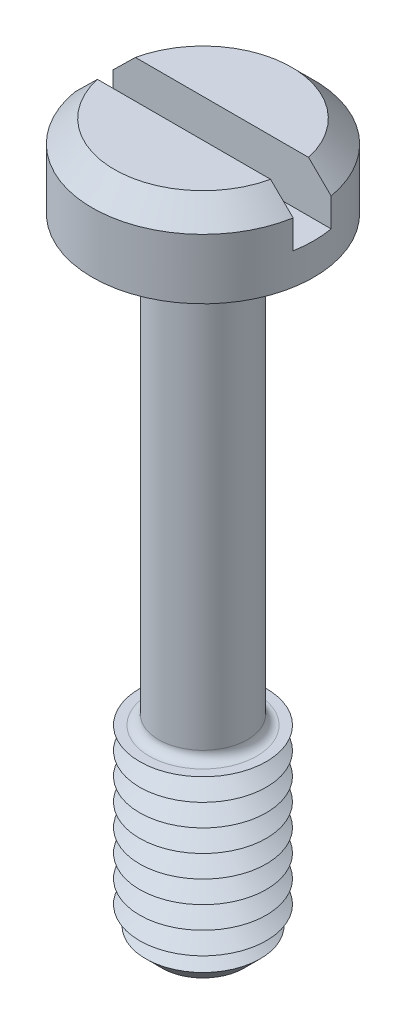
ISO-10303-21;
HEADER;
FILE_DESCRIPTION(('STEP AP214'),'2;1');
FILE_NAME('part.step','',(''),(''),'','','');
FILE_SCHEMA(('AUTOMOTIVE_DESIGN { 1 0 10303 214 1 1 1 1 }'));
ENDSEC;
DATA;
#1=APPLICATION_CONTEXT('core data for automotive mechanical design processes');
#2=APPLICATION_PROTOCOL_DEFINITION('international standard','automotive_design',2000,#1);
#3=PRODUCT_CONTEXT('',#1,'mechanical');
#4=PRODUCT('Part','Part','',(#3));
#5=PRODUCT_RELATED_PRODUCT_CATEGORY('part','',(#4));
#6=PRODUCT_DEFINITION_FORMATION('','',#4);
#7=PRODUCT_DEFINITION_CONTEXT('part definition',#1,'design');
#8=PRODUCT_DEFINITION('design','',#6,#7);
#9=PRODUCT_DEFINITION_SHAPE('','',#8);
#10=(LENGTH_UNIT() NAMED_UNIT(*) SI_UNIT(.MILLI.,.METRE.));
#11=(NAMED_UNIT(*) PLANE_ANGLE_UNIT() SI_UNIT($,.RADIAN.));
#12=(NAMED_UNIT(*) SI_UNIT($,.STERADIAN.) SOLID_ANGLE_UNIT());
#13=UNCERTAINTY_MEASURE_WITH_UNIT(LENGTH_MEASURE(1.E-05),#10,'distance_accuracy_value','');
#14=(GEOMETRIC_REPRESENTATION_CONTEXT(3) GLOBAL_UNCERTAINTY_ASSIGNED_CONTEXT((#13)) GLOBAL_UNIT_ASSIGNED_CONTEXT((#10,
#11,#12)) REPRESENTATION_CONTEXT('',''));
#15=CARTESIAN_POINT('',(0.,0.,0.));
#16=DIRECTION('',(0.,0.,1.));
#17=DIRECTION('',(1.,0.,0.));
#18=AXIS2_PLACEMENT_3D('',#15,#16,#17);
#19=CARTESIAN_POINT('',(0.,2.6,0.));
#20=DIRECTION('',(0.,1.,0.));
#21=DIRECTION('',(0.,0.,1.));
#22=AXIS2_PLACEMENT_3D('',#19,#20,#21);
#23=PLANE('',#22);
#24=DIRECTION('',(-1.,0.,0.));
#25=VECTOR('',#24,1.);
#26=CARTESIAN_POINT('',(3.5,2.6,-0.6));
#27=LINE('',#26,#25);
#28=CARTESIAN_POINT('',(2.73495886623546,2.6,-0.6));
#29=VERTEX_POINT('',#28);
#30=CARTESIAN_POINT('',(-2.73495886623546,2.6,-0.6));
#31=VERTEX_POINT('',#30);
#32=EDGE_CURVE('E110',#29,#31,#27,.T.);
#33=ORIENTED_EDGE('',*,*,#32,.F.);
#34=CARTESIAN_POINT('',(0.,2.6,0.));
#35=DIRECTION('',(0.,1.,0.));
#36=DIRECTION('',(0.,0.,1.));
#37=AXIS2_PLACEMENT_3D('',#34,#35,#36);
#38=CIRCLE('',#37,2.79999999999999);
#39=EDGE_CURVE('E113',#29,#31,#38,.T.);
#40=ORIENTED_EDGE('',*,*,#39,.T.);
#41=EDGE_LOOP('',(#33,#40));
#42=FACE_BOUND('',#41,.T.);
#43=ADVANCED_FACE('F39',(#42),#23,.T.);
#44=CARTESIAN_POINT('',(0.,2.6,0.));
#45=DIRECTION('',(0.,-1.,0.));
#46=DIRECTION('',(0.,0.,-1.));
#47=AXIS2_PLACEMENT_3D('',#44,#45,#46);
#48=CONICAL_SURFACE('',#47,2.79999999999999,0.785398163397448);
#49=CARTESIAN_POINT('',(7.69779986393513,-2.32114776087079,-0.6));
#50=CARTESIAN_POINT('',(7.42456340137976,-2.04874480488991,-0.6));
#51=CARTESIAN_POINT('',(7.15128998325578,-1.77637887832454,-0.6));
#52=CARTESIAN_POINT('',(6.60460779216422,-1.23176088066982,-0.6));
#53=CARTESIAN_POINT('',(6.33119901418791,-0.959508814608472,-0.6));
#54=CARTESIAN_POINT('',(5.78393918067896,-0.41491410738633,-0.6));
#55=CARTESIAN_POINT('',(5.51008795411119,-0.142571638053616,-0.6));
#56=CARTESIAN_POINT('',(4.9621249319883,0.401829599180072,-0.6));
#57=CARTESIAN_POINT('',(4.68801314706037,0.673888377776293,-0.6));
#58=CARTESIAN_POINT('',(4.15230810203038,1.204717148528,-0.6));
#59=CARTESIAN_POINT('',(3.89073524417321,1.4635077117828,-0.6));
#60=CARTESIAN_POINT('',(3.49781694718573,1.85115830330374,-0.6));
#61=CARTESIAN_POINT('',(3.36674319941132,1.98029362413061,-0.6));
#62=CARTESIAN_POINT('',(3.10433907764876,2.23830030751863,-0.6));
#63=CARTESIAN_POINT('',(2.97300870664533,2.36717167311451,-0.6));
#64=CARTESIAN_POINT('',(2.71005235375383,2.62445652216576,-0.6));
#65=CARTESIAN_POINT('',(2.57842659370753,2.75287023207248,-0.6));
#66=CARTESIAN_POINT('',(2.31459302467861,3.00911021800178,-0.6));
#67=CARTESIAN_POINT('',(2.1823851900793,3.13693646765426,-0.6));
#68=CARTESIAN_POINT('',(1.91706128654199,3.39159289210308,-0.6));
#69=CARTESIAN_POINT('',(1.78394541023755,3.51842326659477,-0.6));
#70=CARTESIAN_POINT('',(1.5829745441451,3.70728046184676,-0.6));
#71=CARTESIAN_POINT('',(1.51577053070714,3.76999922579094,-0.6));
#72=CARTESIAN_POINT('',(1.38073587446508,3.89475766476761,-0.6));
#73=CARTESIAN_POINT('',(1.31290524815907,3.95679735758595,-0.6));
#74=CARTESIAN_POINT('',(1.20662362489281,4.05253127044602,-0.6));
#75=CARTESIAN_POINT('',(1.16849592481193,4.08658409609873,-0.6));
#76=CARTESIAN_POINT('',(1.09186306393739,4.15427097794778,-0.6));
#77=CARTESIAN_POINT('',(1.05335786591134,4.18790499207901,-0.6));
#78=CARTESIAN_POINT('',(0.975560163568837,4.25487029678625,-0.6));
#79=CARTESIAN_POINT('',(0.936263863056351,4.28819718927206,-0.6));
#80=CARTESIAN_POINT('',(0.857023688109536,4.3540539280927,-0.6));
#81=CARTESIAN_POINT('',(0.817079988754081,4.38658398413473,-0.6));
#82=CARTESIAN_POINT('',(0.73593206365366,4.45080389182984,-0.6));
#83=CARTESIAN_POINT('',(0.694719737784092,4.48248357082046,-0.6));
#84=CARTESIAN_POINT('',(0.611023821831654,4.54411116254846,-0.6));
#85=CARTESIAN_POINT('',(0.568540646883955,4.5740596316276,-0.6));
#86=CARTESIAN_POINT('',(0.482031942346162,4.63104137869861,-0.6));
#87=CARTESIAN_POINT('',(0.438018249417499,4.65809235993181,-0.6));
#88=CARTESIAN_POINT('',(0.347545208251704,4.70764477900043,-0.6));
#89=CARTESIAN_POINT('',(0.301093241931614,4.73015905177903,-0.6));
#90=CARTESIAN_POINT('',(0.21684063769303,4.76288589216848,-0.6));
#91=CARTESIAN_POINT('',(0.179711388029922,4.77476119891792,-0.6));
#92=CARTESIAN_POINT('',(0.104069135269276,4.79214056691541,-0.6));
#93=CARTESIAN_POINT('',(0.0655630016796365,4.79767265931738,-0.6));
#94=CARTESIAN_POINT('',(-0.0121083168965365,4.80113734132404,-0.6));
#95=CARTESIAN_POINT('',(-0.051276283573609,4.7990121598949,-0.6));
#96=CARTESIAN_POINT('',(-0.128601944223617,4.78758103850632,-0.6));
#97=CARTESIAN_POINT('',(-0.166755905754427,4.77825158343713,-0.6));
#98=CARTESIAN_POINT('',(-0.239985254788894,4.75468984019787,-0.6));
#99=CARTESIAN_POINT('',(-0.275121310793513,4.74063623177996,-0.6));
#100=CARTESIAN_POINT('',(-0.343859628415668,4.70912771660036,-0.6));
#101=CARTESIAN_POINT('',(-0.377459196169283,4.69166709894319,-0.6));
#102=CARTESIAN_POINT('',(-0.443620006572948,4.65431398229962,-0.6));
#103=CARTESIAN_POINT('',(-0.476170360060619,4.63440256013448,-0.6));
#104=CARTESIAN_POINT('',(-0.540208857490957,4.5930114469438,-0.6));
#105=CARTESIAN_POINT('',(-0.571697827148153,4.57153301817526,-0.6));
#106=CARTESIAN_POINT('',(-0.63642661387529,4.52565712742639,-0.6));
#107=CARTESIAN_POINT('',(-0.669598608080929,4.50116466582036,-0.6));
#108=CARTESIAN_POINT('',(-0.735238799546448,4.4512509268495,-0.6));
#109=CARTESIAN_POINT('',(-0.767706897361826,4.4258295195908,-0.6));
#110=CARTESIAN_POINT('',(-0.864340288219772,4.34853769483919,-0.6));
#111=CARTESIAN_POINT('',(-0.927700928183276,4.29566444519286,-0.6));
#112=CARTESIAN_POINT('',(-1.05322030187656,4.18829389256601,-0.6));
#113=CARTESIAN_POINT('',(-1.11537654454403,4.13379371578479,-0.6));
#114=CARTESIAN_POINT('',(-1.23879800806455,4.02383276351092,-0.6));
#115=CARTESIAN_POINT('',(-1.30006349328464,3.96837228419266,-0.6));
#116=CARTESIAN_POINT('',(-1.42182653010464,3.85695373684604,-0.6));
#117=CARTESIAN_POINT('',(-1.48232573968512,3.8009974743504,-0.6));
#118=CARTESIAN_POINT('',(-1.60290045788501,3.68862177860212,-0.6));
#119=CARTESIAN_POINT('',(-1.66297593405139,3.63220231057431,-0.6));
#120=CARTESIAN_POINT('',(-1.84259490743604,3.46258196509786,-0.6));
#121=CARTESIAN_POINT('',(-1.96167258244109,3.34888831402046,-0.6));
#122=CARTESIAN_POINT('',(-2.19942862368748,3.12043467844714,-0.6));
#123=CARTESIAN_POINT('',(-2.31810499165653,3.00567262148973,-0.6));
#124=CARTESIAN_POINT('',(-2.55498513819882,2.77566147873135,-0.6));
#125=CARTESIAN_POINT('',(-2.67318891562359,2.66041239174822,-0.6));
#126=CARTESIAN_POINT('',(-3.0273377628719,2.31418176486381,-0.6));
#127=CARTESIAN_POINT('',(-3.26281496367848,2.08272206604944,-0.6));
#128=CARTESIAN_POINT('',(-3.73326607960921,1.6190281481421,-0.6));
#129=CARTESIAN_POINT('',(-3.96823963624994,1.38679356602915,-0.6));
#130=CARTESIAN_POINT('',(-4.43780370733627,0.921942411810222,-0.6));
#131=CARTESIAN_POINT('',(-4.67239422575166,0.689325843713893,-0.6));
#132=CARTESIAN_POINT('',(-5.13982382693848,0.225350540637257,-0.6));
#133=CARTESIAN_POINT('',(-5.37266445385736,-0.00600663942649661,-0.6));
#134=CARTESIAN_POINT('',(-5.83818541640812,-0.468883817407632,-0.6));
#135=CARTESIAN_POINT('',(-6.07086575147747,-0.700403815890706,-0.6));
#136=CARTESIAN_POINT('',(-6.53596926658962,-1.16341429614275,-0.6));
#137=CARTESIAN_POINT('',(-6.76839251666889,-1.39490470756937,-0.6));
#138=CARTESIAN_POINT('',(-7.23315324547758,-1.85796986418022,-0.6));
#139=CARTESIAN_POINT('',(-7.46549072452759,-2.08954460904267,-0.6));
#140=CARTESIAN_POINT('',(-7.69779986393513,-2.32114776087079,-0.6));
#141=B_SPLINE_CURVE_WITH_KNOTS('',3,(#49,#50,#51,#52,#53,#54,#55,#56,#57,#58,#59,#60,#61,#62,
#63,#64,#65,#66,#67,#68,#69,#70,#71,#72,#73,#74,#75,#76,#77,#78,#79,#80,#81,#82,#83,#84,#85,#86,
#87,#88,#89,#90,#91,#92,#93,#94,#95,#96,#97,#98,#99,#100,#101,#102,#103,#104,#105,#106,#107,
#108,#109,#110,#111,#112,#113,#114,#115,#116,#117,#118,#119,#120,#121,#122,#123,#124,#125,#126,
#127,#128,#129,#130,#131,#132,#133,#134,#135,#136,#137,#138,#139,#140),.UNSPECIFIED.,.F.,.F.,(4,
2,2,2,2,2,2,2,2,2,2,2,2,2,2,2,2,2,2,2,2,2,2,2,2,2,2,2,2,2,2,2,2,2,2,2,2,2,2,2,2,2,2,2,2,4),(0.,
1.15747738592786,2.31500139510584,3.4736574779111,4.63226817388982,5.73614050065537,
6.28814234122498,6.84013779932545,7.39180548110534,7.94349768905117,8.49507629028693,
8.77084567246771,9.04660781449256,9.19996738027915,9.35334222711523,9.50791164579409,
9.66243993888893,9.81835637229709,9.9742224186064,10.1290741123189,10.2834813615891,
10.4000294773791,10.5160605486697,10.6329688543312,10.7502603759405,10.8635386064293,
10.9770083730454,11.0914168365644,11.205734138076,11.3294140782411,11.4531113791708,
11.7006314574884,11.9486181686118,12.1965297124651,12.4437540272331,12.6909970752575,
13.184904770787,13.6801705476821,14.1754375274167,15.1659939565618,16.1571087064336,
17.1482131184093,18.1329303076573,19.1176509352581,20.1017623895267,21.0858701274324),.UNSPECIFIED.);
#142=CARTESIAN_POINT('',(3.44818792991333,1.89999999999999,-0.6));
#143=VERTEX_POINT('',#142);
#144=EDGE_CURVE('E259',#143,#29,#141,.T.);
#145=ORIENTED_EDGE('',*,*,#144,.F.);
#146=CARTESIAN_POINT('',(0.,1.89999999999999,0.));
#147=DIRECTION('',(0.,1.,0.));
#148=DIRECTION('',(0.,0.,1.));
#149=AXIS2_PLACEMENT_3D('',#146,#147,#148);
#150=CIRCLE('',#149,3.5);
#151=CARTESIAN_POINT('',(-3.44818792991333,1.89999999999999,-0.6));
#152=VERTEX_POINT('',#151);
#153=EDGE_CURVE('E127',#152,#143,#150,.F.);
#154=ORIENTED_EDGE('',*,*,#153,.F.);
#155=EDGE_CURVE('E102',#31,#152,#141,.T.);
#156=ORIENTED_EDGE('',*,*,#155,.F.);
#157=ORIENTED_EDGE('',*,*,#39,.F.);
#158=EDGE_LOOP('',(#145,#154,#156,#157));
#159=FACE_BOUND('',#158,.T.);
#160=ADVANCED_FACE('F221',(#159),#48,.T.);
#161=CARTESIAN_POINT('',(0.,-20.,0.));
#162=DIRECTION('',(0.,1.,0.));
#163=DIRECTION('',(0.,0.,1.));
#164=AXIS2_PLACEMENT_3D('',#161,#162,#163);
#165=CYLINDRICAL_SURFACE('',#164,1.4);
#166=CARTESIAN_POINT('',(0.,-13.7,0.));
#167=DIRECTION('',(0.,-1.,0.));
#168=DIRECTION('',(0.,0.,-1.));
#169=AXIS2_PLACEMENT_3D('',#166,#167,#168);
#170=CIRCLE('',#169,1.4);
#171=CARTESIAN_POINT('',(0.,-13.7,-1.4));
#172=VERTEX_POINT('',#171);
#173=EDGE_CURVE('E123',#172,#172,#170,.F.);
#174=ORIENTED_EDGE('',*,*,#173,.T.);
#175=EDGE_LOOP('',(#174));
#176=FACE_BOUND('',#175,.T.);
#177=CARTESIAN_POINT('',(0.,-0.300000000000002,0.));
#178=DIRECTION('',(0.,1.,0.));
#179=DIRECTION('',(0.,0.,1.));
#180=AXIS2_PLACEMENT_3D('',#177,#178,#179);
#181=CIRCLE('',#180,1.4);
#182=CARTESIAN_POINT('',(0.,-0.300000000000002,1.4));
#183=VERTEX_POINT('',#182);
#184=EDGE_CURVE('E365',#183,#183,#181,.F.);
#185=ORIENTED_EDGE('',*,*,#184,.T.);
#186=EDGE_LOOP('',(#185));
#187=FACE_BOUND('',#186,.T.);
#188=ADVANCED_FACE('F217',(#176,#187),#165,.T.);
#189=CARTESIAN_POINT('',(0.,2.6,0.));
#190=DIRECTION('',(0.,-1.,0.));
#191=DIRECTION('',(0.,0.,-1.));
#192=AXIS2_PLACEMENT_3D('',#189,#190,#191);
#193=CYLINDRICAL_SURFACE('',#192,3.5);
#194=ORIENTED_EDGE('',*,*,#153,.T.);
#195=DIRECTION('',(0.,-1.,0.));
#196=VECTOR('',#195,1.);
#197=CARTESIAN_POINT('',(3.44818792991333,2.6,-0.6));
#198=LINE('',#197,#196);
#199=CARTESIAN_POINT('',(3.44818792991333,1.,-0.6));
#200=VERTEX_POINT('',#199);
#201=EDGE_CURVE('E64',#143,#200,#198,.T.);
#202=ORIENTED_EDGE('',*,*,#201,.T.);
#203=CARTESIAN_POINT('',(0.,1.,0.));
#204=DIRECTION('',(0.,1.,0.));
#205=DIRECTION('',(0.,0.,1.));
#206=AXIS2_PLACEMENT_3D('',#203,#204,#205);
#207=CIRCLE('',#206,3.5);
#208=CARTESIAN_POINT('',(3.44818792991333,1.,0.6));
#209=VERTEX_POINT('',#208);
#210=EDGE_CURVE('E11',#209,#200,#207,.T.);
#211=ORIENTED_EDGE('',*,*,#210,.F.);
#212=DIRECTION('',(0.,-1.,0.));
#213=VECTOR('',#212,1.);
#214=CARTESIAN_POINT('',(3.44818792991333,2.6,0.6));
#215=LINE('',#214,#213);
#216=CARTESIAN_POINT('',(3.44818792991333,1.89999999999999,0.6));
#217=VERTEX_POINT('',#216);
#218=EDGE_CURVE('E278',#209,#217,#215,.F.);
#219=ORIENTED_EDGE('',*,*,#218,.T.);
#220=CARTESIAN_POINT('',(-3.44818792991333,1.89999999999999,0.6));
#221=VERTEX_POINT('',#220);
#222=EDGE_CURVE('E120',#217,#221,#150,.F.);
#223=ORIENTED_EDGE('',*,*,#222,.T.);
#224=DIRECTION('',(0.,-1.,0.));
#225=VECTOR('',#224,1.);
#226=CARTESIAN_POINT('',(-3.44818792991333,2.6,0.6));
#227=LINE('',#226,#225);
#228=CARTESIAN_POINT('',(-3.44818792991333,1.,0.6));
#229=VERTEX_POINT('',#228);
#230=EDGE_CURVE('E96',#221,#229,#227,.T.);
#231=ORIENTED_EDGE('',*,*,#230,.T.);
#232=CARTESIAN_POINT('',(-3.44818792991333,1.,-0.6));
#233=VERTEX_POINT('',#232);
#234=EDGE_CURVE('E44',#233,#229,#207,.T.);
#235=ORIENTED_EDGE('',*,*,#234,.F.);
#236=DIRECTION('',(0.,-1.,0.));
#237=VECTOR('',#236,1.);
#238=CARTESIAN_POINT('',(-3.44818792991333,2.6,-0.6));
#239=LINE('',#238,#237);
#240=EDGE_CURVE('E282',#233,#152,#239,.F.);
#241=ORIENTED_EDGE('',*,*,#240,.T.);
#242=EDGE_LOOP('',(#194,#202,#211,#219,#223,#231,#235,#241));
#243=FACE_BOUND('',#242,.T.);
#244=CARTESIAN_POINT('',(0.,0.,0.));
#245=DIRECTION('',(0.,1.,0.));
#246=DIRECTION('',(0.,0.,1.));
#247=AXIS2_PLACEMENT_3D('',#244,#245,#246);
#248=CIRCLE('',#247,3.5);
#249=CARTESIAN_POINT('',(0.,0.,3.5));
#250=VERTEX_POINT('',#249);
#251=EDGE_CURVE('E350',#250,#250,#248,.T.);
#252=ORIENTED_EDGE('',*,*,#251,.T.);
#253=EDGE_LOOP('',(#252));
#254=FACE_BOUND('',#253,.T.);
#255=ADVANCED_FACE('F220',(#243,#254),#193,.T.);
#256=DIRECTION('',(1.,0.,0.));
#257=VECTOR('',#256,1.);
#258=CARTESIAN_POINT('',(3.5,2.6,0.6));
#259=LINE('',#258,#257);
#260=CARTESIAN_POINT('',(-2.73495886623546,2.6,0.6));
#261=VERTEX_POINT('',#260);
#262=CARTESIAN_POINT('',(2.73495886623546,2.6,0.6));
#263=VERTEX_POINT('',#262);
#264=EDGE_CURVE('E56',#261,#263,#259,.T.);
#265=ORIENTED_EDGE('',*,*,#264,.F.);
#266=EDGE_CURVE('E108',#261,#263,#38,.T.);
#267=ORIENTED_EDGE('',*,*,#266,.T.);
#268=EDGE_LOOP('',(#265,#267));
#269=FACE_BOUND('',#268,.T.);
#270=ADVANCED_FACE('F107',(#269),#23,.T.);
#271=CARTESIAN_POINT('',(0.,0.,0.));
#272=DIRECTION('',(0.,1.,0.));
#273=DIRECTION('',(0.,0.,1.));
#274=AXIS2_PLACEMENT_3D('',#271,#272,#273);
#275=PLANE('',#274);
#276=CARTESIAN_POINT('',(0.,0.,0.));
#277=DIRECTION('',(0.,1.,0.));
#278=DIRECTION('',(0.,0.,1.));
#279=AXIS2_PLACEMENT_3D('',#276,#277,#278);
#280=CIRCLE('',#279,1.7);
#281=CARTESIAN_POINT('',(0.,0.,1.7));
#282=VERTEX_POINT('',#281);
#283=EDGE_CURVE('E114',#282,#282,#280,.T.);
#284=ORIENTED_EDGE('',*,*,#283,.T.);
#285=EDGE_LOOP('',(#284));
#286=FACE_BOUND('',#285,.T.);
#287=ORIENTED_EDGE('',*,*,#251,.F.);
#288=EDGE_LOOP('',(#287));
#289=FACE_BOUND('',#288,.T.);
#290=ADVANCED_FACE('F211',(#286,#289),#275,.F.);
#291=CARTESIAN_POINT('',(0.,-14.,0.));
#292=DIRECTION('',(0.,-1.,0.));
#293=DIRECTION('',(0.,0.,-1.));
#294=AXIS2_PLACEMENT_3D('',#291,#292,#293);
#295=PLANE('',#294);
#296=CARTESIAN_POINT('',(0.,-14.,0.));
#297=DIRECTION('',(0.,-1.,0.));
#298=DIRECTION('',(0.,0.,-1.));
#299=AXIS2_PLACEMENT_3D('',#296,#297,#298);
#300=CIRCLE('',#299,1.7);
#301=CARTESIAN_POINT('',(0.,-14.,-1.7));
#302=VERTEX_POINT('',#301);
#303=EDGE_CURVE('E358',#302,#302,#300,.T.);
#304=ORIENTED_EDGE('',*,*,#303,.T.);
#305=EDGE_LOOP('',(#304));
#306=FACE_BOUND('',#305,.T.);
#307=CARTESIAN_POINT('',(0.,-14.,0.));
#308=DIRECTION('',(0.,1.,0.));
#309=DIRECTION('',(0.,0.,1.));
#310=AXIS2_PLACEMENT_3D('',#307,#308,#309);
#311=CIRCLE('',#310,2.);
#312=CARTESIAN_POINT('',(0.,-14.,2.));
#313=VERTEX_POINT('',#312);
#314=EDGE_CURVE('E346',#313,#313,#311,.T.);
#315=ORIENTED_EDGE('',*,*,#314,.T.);
#316=EDGE_LOOP('',(#315));
#317=FACE_BOUND('',#316,.T.);
#318=ADVANCED_FACE('F207',(#306,#317),#295,.F.);
#319=CARTESIAN_POINT('',(0.,-14.35,0.));
#320=DIRECTION('',(0.,1.,0.));
#321=DIRECTION('',(0.,0.,1.));
#322=AXIS2_PLACEMENT_3D('',#319,#320,#321);
#323=CONICAL_SURFACE('',#322,1.39378221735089,1.0471975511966);
#324=ORIENTED_EDGE('',*,*,#314,.F.);
#325=EDGE_LOOP('',(#324));
#326=FACE_BOUND('',#325,.T.);
#327=CARTESIAN_POINT('',(0.,-14.35,0.));
#328=DIRECTION('',(0.,1.,0.));
#329=DIRECTION('',(0.,0.,1.));
#330=AXIS2_PLACEMENT_3D('',#327,#328,#329);
#331=CIRCLE('',#330,1.39378221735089);
#332=CARTESIAN_POINT('',(0.,-14.35,1.39378221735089));
#333=VERTEX_POINT('',#332);
#334=EDGE_CURVE('E342',#333,#333,#331,.T.);
#335=ORIENTED_EDGE('',*,*,#334,.T.);
#336=EDGE_LOOP('',(#335));
#337=FACE_BOUND('',#336,.T.);
#338=ADVANCED_FACE('F203',(#326,#337),#323,.T.);
#339=CARTESIAN_POINT('',(0.,-14.7,0.));
#340=DIRECTION('',(0.,-1.,0.));
#341=DIRECTION('',(0.,0.,-1.));
#342=AXIS2_PLACEMENT_3D('',#339,#340,#341);
#343=CONICAL_SURFACE('',#342,2.,1.0471975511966);
#344=ORIENTED_EDGE('',*,*,#334,.F.);
#345=EDGE_LOOP('',(#344));
#346=FACE_BOUND('',#345,.T.);
#347=CARTESIAN_POINT('',(0.,-14.7,0.));
#348=DIRECTION('',(0.,1.,0.));
#349=DIRECTION('',(0.,0.,1.));
#350=AXIS2_PLACEMENT_3D('',#347,#348,#349);
#351=CIRCLE('',#350,2.);
#352=CARTESIAN_POINT('',(0.,-14.7,2.));
#353=VERTEX_POINT('',#352);
#354=EDGE_CURVE('E339',#353,#353,#351,.T.);
#355=ORIENTED_EDGE('',*,*,#354,.T.);
#356=EDGE_LOOP('',(#355));
#357=FACE_BOUND('',#356,.T.);
#358=ADVANCED_FACE('F199',(#346,#357),#343,.T.);
#359=CARTESIAN_POINT('',(0.,-15.05,0.));
#360=DIRECTION('',(0.,1.,0.));
#361=DIRECTION('',(0.,0.,1.));
#362=AXIS2_PLACEMENT_3D('',#359,#360,#361);
#363=CONICAL_SURFACE('',#362,1.39378221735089,1.0471975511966);
#364=ORIENTED_EDGE('',*,*,#354,.F.);
#365=EDGE_LOOP('',(#364));
#366=FACE_BOUND('',#365,.T.);
#367=CARTESIAN_POINT('',(0.,-15.05,0.));
#368=DIRECTION('',(0.,1.,0.));
#369=DIRECTION('',(0.,0.,1.));
#370=AXIS2_PLACEMENT_3D('',#367,#368,#369);
#371=CIRCLE('',#370,1.39378221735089);
#372=CARTESIAN_POINT('',(0.,-15.05,1.39378221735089));
#373=VERTEX_POINT('',#372);
#374=EDGE_CURVE('E335',#373,#373,#371,.T.);
#375=ORIENTED_EDGE('',*,*,#374,.T.);
#376=EDGE_LOOP('',(#375));
#377=FACE_BOUND('',#376,.T.);
#378=ADVANCED_FACE('F195',(#366,#377),#363,.T.);
#379=CARTESIAN_POINT('',(0.,-15.4,0.));
#380=DIRECTION('',(0.,-1.,0.));
#381=DIRECTION('',(0.,0.,-1.));
#382=AXIS2_PLACEMENT_3D('',#379,#380,#381);
#383=CONICAL_SURFACE('',#382,2.,1.0471975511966);
#384=ORIENTED_EDGE('',*,*,#374,.F.);
#385=EDGE_LOOP('',(#384));
#386=FACE_BOUND('',#385,.T.);
#387=CARTESIAN_POINT('',(0.,-15.4,0.));
#388=DIRECTION('',(0.,1.,0.));
#389=DIRECTION('',(0.,0.,1.));
#390=AXIS2_PLACEMENT_3D('',#387,#388,#389);
#391=CIRCLE('',#390,2.);
#392=CARTESIAN_POINT('',(0.,-15.4,2.));
#393=VERTEX_POINT('',#392);
#394=EDGE_CURVE('E331',#393,#393,#391,.T.);
#395=ORIENTED_EDGE('',*,*,#394,.T.);
#396=EDGE_LOOP('',(#395));
#397=FACE_BOUND('',#396,.T.);
#398=ADVANCED_FACE('F191',(#386,#397),#383,.T.);
#399=CARTESIAN_POINT('',(0.,-15.75,0.));
#400=DIRECTION('',(0.,1.,0.));
#401=DIRECTION('',(0.,0.,1.));
#402=AXIS2_PLACEMENT_3D('',#399,#400,#401);
#403=CONICAL_SURFACE('',#402,1.39378221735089,1.0471975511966);
#404=ORIENTED_EDGE('',*,*,#394,.F.);
#405=EDGE_LOOP('',(#404));
#406=FACE_BOUND('',#405,.T.);
#407=CARTESIAN_POINT('',(0.,-15.75,0.));
#408=DIRECTION('',(0.,1.,0.));
#409=DIRECTION('',(0.,0.,1.));
#410=AXIS2_PLACEMENT_3D('',#407,#408,#409);
#411=CIRCLE('',#410,1.39378221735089);
#412=CARTESIAN_POINT('',(0.,-15.75,1.39378221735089));
#413=VERTEX_POINT('',#412);
#414=EDGE_CURVE('E327',#413,#413,#411,.T.);
#415=ORIENTED_EDGE('',*,*,#414,.T.);
#416=EDGE_LOOP('',(#415));
#417=FACE_BOUND('',#416,.T.);
#418=ADVANCED_FACE('F187',(#406,#417),#403,.T.);
#419=CARTESIAN_POINT('',(0.,-16.1,0.));
#420=DIRECTION('',(0.,-1.,0.));
#421=DIRECTION('',(0.,0.,-1.));
#422=AXIS2_PLACEMENT_3D('',#419,#420,#421);
#423=CONICAL_SURFACE('',#422,2.,1.0471975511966);
#424=ORIENTED_EDGE('',*,*,#414,.F.);
#425=EDGE_LOOP('',(#424));
#426=FACE_BOUND('',#425,.T.);
#427=CARTESIAN_POINT('',(0.,-16.1,0.));
#428=DIRECTION('',(0.,1.,0.));
#429=DIRECTION('',(0.,0.,1.));
#430=AXIS2_PLACEMENT_3D('',#427,#428,#429);
#431=CIRCLE('',#430,2.);
#432=CARTESIAN_POINT('',(0.,-16.1,2.));
#433=VERTEX_POINT('',#432);
#434=EDGE_CURVE('E323',#433,#433,#431,.T.);
#435=ORIENTED_EDGE('',*,*,#434,.T.);
#436=EDGE_LOOP('',(#435));
#437=FACE_BOUND('',#436,.T.);
#438=ADVANCED_FACE('F183',(#426,#437),#423,.T.);
#439=CARTESIAN_POINT('',(0.,-16.45,0.));
#440=DIRECTION('',(0.,1.,0.));
#441=DIRECTION('',(0.,0.,1.));
#442=AXIS2_PLACEMENT_3D('',#439,#440,#441);
#443=CONICAL_SURFACE('',#442,1.39378221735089,1.0471975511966);
#444=ORIENTED_EDGE('',*,*,#434,.F.);
#445=EDGE_LOOP('',(#444));
#446=FACE_BOUND('',#445,.T.);
#447=CARTESIAN_POINT('',(0.,-16.45,0.));
#448=DIRECTION('',(0.,1.,0.));
#449=DIRECTION('',(0.,0.,1.));
#450=AXIS2_PLACEMENT_3D('',#447,#448,#449);
#451=CIRCLE('',#450,1.39378221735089);
#452=CARTESIAN_POINT('',(0.,-16.45,1.39378221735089));
#453=VERTEX_POINT('',#452);
#454=EDGE_CURVE('E320',#453,#453,#451,.T.);
#455=ORIENTED_EDGE('',*,*,#454,.T.);
#456=EDGE_LOOP('',(#455));
#457=FACE_BOUND('',#456,.T.);
#458=ADVANCED_FACE('F179',(#446,#457),#443,.T.);
#459=CARTESIAN_POINT('',(0.,-16.8,0.));
#460=DIRECTION('',(0.,-1.,0.));
#461=DIRECTION('',(0.,0.,-1.));
#462=AXIS2_PLACEMENT_3D('',#459,#460,#461);
#463=CONICAL_SURFACE('',#462,2.,1.0471975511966);
#464=ORIENTED_EDGE('',*,*,#454,.F.);
#465=EDGE_LOOP('',(#464));
#466=FACE_BOUND('',#465,.T.);
#467=CARTESIAN_POINT('',(0.,-16.8,0.));
#468=DIRECTION('',(0.,1.,0.));
#469=DIRECTION('',(0.,0.,1.));
#470=AXIS2_PLACEMENT_3D('',#467,#468,#469);
#471=CIRCLE('',#470,2.);
#472=CARTESIAN_POINT('',(0.,-16.8,2.));
#473=VERTEX_POINT('',#472);
#474=EDGE_CURVE('E316',#473,#473,#471,.T.);
#475=ORIENTED_EDGE('',*,*,#474,.T.);
#476=EDGE_LOOP('',(#475));
#477=FACE_BOUND('',#476,.T.);
#478=ADVANCED_FACE('F175',(#466,#477),#463,.T.);
#479=CARTESIAN_POINT('',(0.,-17.15,0.));
#480=DIRECTION('',(0.,1.,0.));
#481=DIRECTION('',(0.,0.,1.));
#482=AXIS2_PLACEMENT_3D('',#479,#480,#481);
#483=CONICAL_SURFACE('',#482,1.39378221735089,1.0471975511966);
#484=ORIENTED_EDGE('',*,*,#474,.F.);
#485=EDGE_LOOP('',(#484));
#486=FACE_BOUND('',#485,.T.);
#487=CARTESIAN_POINT('',(0.,-17.15,0.));
#488=DIRECTION('',(0.,1.,0.));
#489=DIRECTION('',(0.,0.,1.));
#490=AXIS2_PLACEMENT_3D('',#487,#488,#489);
#491=CIRCLE('',#490,1.39378221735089);
#492=CARTESIAN_POINT('',(0.,-17.15,1.39378221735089));
#493=VERTEX_POINT('',#492);
#494=EDGE_CURVE('E312',#493,#493,#491,.T.);
#495=ORIENTED_EDGE('',*,*,#494,.T.);
#496=EDGE_LOOP('',(#495));
#497=FACE_BOUND('',#496,.T.);
#498=ADVANCED_FACE('F171',(#486,#497),#483,.T.);
#499=CARTESIAN_POINT('',(0.,-17.5,0.));
#500=DIRECTION('',(0.,-1.,0.));
#501=DIRECTION('',(0.,0.,-1.));
#502=AXIS2_PLACEMENT_3D('',#499,#500,#501);
#503=CONICAL_SURFACE('',#502,2.,1.0471975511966);
#504=ORIENTED_EDGE('',*,*,#494,.F.);
#505=EDGE_LOOP('',(#504));
#506=FACE_BOUND('',#505,.T.);
#507=CARTESIAN_POINT('',(0.,-17.5,0.));
#508=DIRECTION('',(0.,1.,0.));
#509=DIRECTION('',(0.,0.,1.));
#510=AXIS2_PLACEMENT_3D('',#507,#508,#509);
#511=CIRCLE('',#510,2.);
#512=CARTESIAN_POINT('',(0.,-17.5,2.));
#513=VERTEX_POINT('',#512);
#514=EDGE_CURVE('E308',#513,#513,#511,.T.);
#515=ORIENTED_EDGE('',*,*,#514,.T.);
#516=EDGE_LOOP('',(#515));
#517=FACE_BOUND('',#516,.T.);
#518=ADVANCED_FACE('F167',(#506,#517),#503,.T.);
#519=CARTESIAN_POINT('',(0.,-17.85,0.));
#520=DIRECTION('',(0.,1.,0.));
#521=DIRECTION('',(0.,0.,1.));
#522=AXIS2_PLACEMENT_3D('',#519,#520,#521);
#523=CONICAL_SURFACE('',#522,1.39378221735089,1.0471975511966);
#524=ORIENTED_EDGE('',*,*,#514,.F.);
#525=EDGE_LOOP('',(#524));
#526=FACE_BOUND('',#525,.T.);
#527=CARTESIAN_POINT('',(0.,-17.85,0.));
#528=DIRECTION('',(0.,1.,0.));
#529=DIRECTION('',(0.,0.,1.));
#530=AXIS2_PLACEMENT_3D('',#527,#528,#529);
#531=CIRCLE('',#530,1.39378221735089);
#532=CARTESIAN_POINT('',(0.,-17.85,1.39378221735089));
#533=VERTEX_POINT('',#532);
#534=EDGE_CURVE('E304',#533,#533,#531,.T.);
#535=ORIENTED_EDGE('',*,*,#534,.T.);
#536=EDGE_LOOP('',(#535));
#537=FACE_BOUND('',#536,.T.);
#538=ADVANCED_FACE('F163',(#526,#537),#523,.T.);
#539=CARTESIAN_POINT('',(0.,-18.2,0.));
#540=DIRECTION('',(0.,-1.,0.));
#541=DIRECTION('',(0.,0.,-1.));
#542=AXIS2_PLACEMENT_3D('',#539,#540,#541);
#543=CONICAL_SURFACE('',#542,2.,1.0471975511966);
#544=ORIENTED_EDGE('',*,*,#534,.F.);
#545=EDGE_LOOP('',(#544));
#546=FACE_BOUND('',#545,.T.);
#547=CARTESIAN_POINT('',(0.,-18.2,0.));
#548=DIRECTION('',(0.,1.,0.));
#549=DIRECTION('',(0.,0.,1.));
#550=AXIS2_PLACEMENT_3D('',#547,#548,#549);
#551=CIRCLE('',#550,2.);
#552=CARTESIAN_POINT('',(0.,-18.2,2.));
#553=VERTEX_POINT('',#552);
#554=EDGE_CURVE('E300',#553,#553,#551,.T.);
#555=ORIENTED_EDGE('',*,*,#554,.T.);
#556=EDGE_LOOP('',(#555));
#557=FACE_BOUND('',#556,.T.);
#558=ADVANCED_FACE('F159',(#546,#557),#543,.T.);
#559=CARTESIAN_POINT('',(0.,-18.55,0.));
#560=DIRECTION('',(0.,1.,0.));
#561=DIRECTION('',(0.,0.,1.));
#562=AXIS2_PLACEMENT_3D('',#559,#560,#561);
#563=CONICAL_SURFACE('',#562,1.39378221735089,1.0471975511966);
#564=ORIENTED_EDGE('',*,*,#554,.F.);
#565=EDGE_LOOP('',(#564));
#566=FACE_BOUND('',#565,.T.);
#567=CARTESIAN_POINT('',(0.,-18.55,0.));
#568=DIRECTION('',(0.,1.,0.));
#569=DIRECTION('',(0.,0.,1.));
#570=AXIS2_PLACEMENT_3D('',#567,#568,#569);
#571=CIRCLE('',#570,1.39378221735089);
#572=CARTESIAN_POINT('',(0.,-18.55,1.39378221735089));
#573=VERTEX_POINT('',#572);
#574=EDGE_CURVE('E297',#573,#573,#571,.T.);
#575=ORIENTED_EDGE('',*,*,#574,.T.);
#576=EDGE_LOOP('',(#575));
#577=FACE_BOUND('',#576,.T.);
#578=ADVANCED_FACE('F155',(#566,#577),#563,.T.);
#579=CARTESIAN_POINT('',(0.,-18.9,0.));
#580=DIRECTION('',(0.,-1.,0.));
#581=DIRECTION('',(0.,0.,-1.));
#582=AXIS2_PLACEMENT_3D('',#579,#580,#581);
#583=CONICAL_SURFACE('',#582,2.,1.0471975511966);
#584=ORIENTED_EDGE('',*,*,#574,.F.);
#585=EDGE_LOOP('',(#584));
#586=FACE_BOUND('',#585,.T.);
#587=CARTESIAN_POINT('',(0.,-18.9,0.));
#588=DIRECTION('',(0.,1.,0.));
#589=DIRECTION('',(0.,0.,1.));
#590=AXIS2_PLACEMENT_3D('',#587,#588,#589);
#591=CIRCLE('',#590,2.);
#592=CARTESIAN_POINT('',(0.,-18.9,2.));
#593=VERTEX_POINT('',#592);
#594=EDGE_CURVE('E292',#593,#593,#591,.T.);
#595=ORIENTED_EDGE('',*,*,#594,.T.);
#596=EDGE_LOOP('',(#595));
#597=FACE_BOUND('',#596,.T.);
#598=ADVANCED_FACE('F151',(#586,#597),#583,.T.);
#599=CARTESIAN_POINT('',(0.,-19.25,0.));
#600=DIRECTION('',(0.,1.,0.));
#601=DIRECTION('',(0.,0.,1.));
#602=AXIS2_PLACEMENT_3D('',#599,#600,#601);
#603=CONICAL_SURFACE('',#602,1.39378221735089,1.0471975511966);
#604=ORIENTED_EDGE('',*,*,#594,.F.);
#605=EDGE_LOOP('',(#604));
#606=FACE_BOUND('',#605,.T.);
#607=CARTESIAN_POINT('',(0.,-19.25,0.));
#608=DIRECTION('',(0.,1.,0.));
#609=DIRECTION('',(0.,0.,1.));
#610=AXIS2_PLACEMENT_3D('',#607,#608,#609);
#611=CIRCLE('',#610,1.39378221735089);
#612=CARTESIAN_POINT('',(0.,-19.25,1.39378221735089));
#613=VERTEX_POINT('',#612);
#614=EDGE_CURVE('E288',#613,#613,#611,.T.);
#615=ORIENTED_EDGE('',*,*,#614,.T.);
#616=EDGE_LOOP('',(#615));
#617=FACE_BOUND('',#616,.T.);
#618=ADVANCED_FACE('F147',(#606,#617),#603,.T.);
#619=CARTESIAN_POINT('',(0.,-19.6,0.));
#620=DIRECTION('',(0.,-1.,0.));
#621=DIRECTION('',(0.,0.,-1.));
#622=AXIS2_PLACEMENT_3D('',#619,#620,#621);
#623=CONICAL_SURFACE('',#622,2.,1.0471975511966);
#624=CARTESIAN_POINT('',(0.,-19.4901923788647,0.));
#625=DIRECTION('',(0.,-1.,0.));
#626=DIRECTION('',(0.,0.,-1.));
#627=AXIS2_PLACEMENT_3D('',#624,#625,#626);
#628=CIRCLE('',#627,1.80980762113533);
#629=CARTESIAN_POINT('',(0.,-19.4901923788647,-1.80980762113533));
#630=VERTEX_POINT('',#629);
#631=EDGE_CURVE('E296',#630,#630,#628,.F.);
#632=ORIENTED_EDGE('',*,*,#631,.T.);
#633=EDGE_LOOP('',(#632));
#634=FACE_BOUND('',#633,.T.);
#635=ORIENTED_EDGE('',*,*,#614,.F.);
#636=EDGE_LOOP('',(#635));
#637=FACE_BOUND('',#636,.T.);
#638=ADVANCED_FACE('F143',(#634,#637),#623,.T.);
#639=CARTESIAN_POINT('',(0.,-20.,0.));
#640=DIRECTION('',(0.,-1.,0.));
#641=DIRECTION('',(0.,0.,-1.));
#642=AXIS2_PLACEMENT_3D('',#639,#640,#641);
#643=PLANE('',#642);
#644=CARTESIAN_POINT('',(0.,-20.,0.));
#645=DIRECTION('',(0.,-1.,0.));
#646=DIRECTION('',(0.,0.,-1.));
#647=AXIS2_PLACEMENT_3D('',#644,#645,#646);
#648=CIRCLE('',#647,1.3);
#649=CARTESIAN_POINT('',(0.,-20.,-1.3));
#650=VERTEX_POINT('',#649);
#651=EDGE_CURVE('E354',#650,#650,#648,.T.);
#652=ORIENTED_EDGE('',*,*,#651,.T.);
#653=EDGE_LOOP('',(#652));
#654=FACE_BOUND('',#653,.T.);
#655=ADVANCED_FACE('F146',(#654),#643,.T.);
#656=CARTESIAN_POINT('',(0.,-20.,0.));
#657=DIRECTION('',(0.,1.,0.));
#658=DIRECTION('',(0.,0.,1.));
#659=AXIS2_PLACEMENT_3D('',#656,#657,#658);
#660=CONICAL_SURFACE('',#659,1.3,0.785398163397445);
#661=ORIENTED_EDGE('',*,*,#631,.F.);
#662=EDGE_LOOP('',(#661));
#663=FACE_BOUND('',#662,.T.);
#664=ORIENTED_EDGE('',*,*,#651,.F.);
#665=EDGE_LOOP('',(#664));
#666=FACE_BOUND('',#665,.T.);
#667=ADVANCED_FACE('F215',(#663,#666),#660,.T.);
#668=CARTESIAN_POINT('',(0.,-13.7,0.));
#669=DIRECTION('',(0.,-1.,0.));
#670=DIRECTION('',(0.,0.,-1.));
#671=AXIS2_PLACEMENT_3D('',#668,#669,#670);
#672=TOROIDAL_SURFACE('',#671,1.7,0.3);
#673=ORIENTED_EDGE('',*,*,#173,.F.);
#674=EDGE_LOOP('',(#673));
#675=FACE_BOUND('',#674,.T.);
#676=ORIENTED_EDGE('',*,*,#303,.F.);
#677=EDGE_LOOP('',(#676));
#678=FACE_BOUND('',#677,.T.);
#679=ADVANCED_FACE('F233',(#675,#678),#672,.F.);
#680=CARTESIAN_POINT('',(0.,-0.300000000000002,0.));
#681=DIRECTION('',(0.,1.,0.));
#682=DIRECTION('',(0.,0.,1.));
#683=AXIS2_PLACEMENT_3D('',#680,#681,#682);
#684=TOROIDAL_SURFACE('',#683,1.7,0.3);
#685=ORIENTED_EDGE('',*,*,#283,.F.);
#686=EDGE_LOOP('',(#685));
#687=FACE_BOUND('',#686,.T.);
#688=ORIENTED_EDGE('',*,*,#184,.F.);
#689=EDGE_LOOP('',(#688));
#690=FACE_BOUND('',#689,.T.);
#691=ADVANCED_FACE('F236',(#687,#690),#684,.F.);
#692=CARTESIAN_POINT('',(-7.69779986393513,-2.32114776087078,0.6));
#693=CARTESIAN_POINT('',(-7.42456340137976,-2.0487448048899,0.6));
#694=CARTESIAN_POINT('',(-7.15128998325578,-1.77637887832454,0.6));
#695=CARTESIAN_POINT('',(-6.60460779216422,-1.23176088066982,0.6));
#696=CARTESIAN_POINT('',(-6.33119901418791,-0.959508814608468,0.6));
#697=CARTESIAN_POINT('',(-5.78393918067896,-0.414914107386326,0.6));
#698=CARTESIAN_POINT('',(-5.51008795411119,-0.142571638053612,0.6));
#699=CARTESIAN_POINT('',(-4.96212493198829,0.401829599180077,0.6));
#700=CARTESIAN_POINT('',(-4.68801314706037,0.673888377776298,0.6));
#701=CARTESIAN_POINT('',(-4.15230810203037,1.204717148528,0.6));
#702=CARTESIAN_POINT('',(-3.89073524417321,1.46350771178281,0.6));
#703=CARTESIAN_POINT('',(-3.49781694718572,1.85115830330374,0.6));
#704=CARTESIAN_POINT('',(-3.36674319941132,1.98029362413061,0.6));
#705=CARTESIAN_POINT('',(-3.10433907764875,2.23830030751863,0.6));
#706=CARTESIAN_POINT('',(-2.97300870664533,2.36717167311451,0.6));
#707=CARTESIAN_POINT('',(-2.71005235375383,2.62445652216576,0.6));
#708=CARTESIAN_POINT('',(-2.57842659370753,2.75287023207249,0.6));
#709=CARTESIAN_POINT('',(-2.31459302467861,3.00911021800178,0.6));
#710=CARTESIAN_POINT('',(-2.1823851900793,3.13693646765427,0.6));
#711=CARTESIAN_POINT('',(-1.91706128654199,3.39159289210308,0.6));
#712=CARTESIAN_POINT('',(-1.78394541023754,3.51842326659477,0.6));
#713=CARTESIAN_POINT('',(-1.5829745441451,3.70728046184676,0.6));
#714=CARTESIAN_POINT('',(-1.51577053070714,3.76999922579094,0.6));
#715=CARTESIAN_POINT('',(-1.38073587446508,3.89475766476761,0.6));
#716=CARTESIAN_POINT('',(-1.31290524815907,3.95679735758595,0.6));
#717=CARTESIAN_POINT('',(-1.20662362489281,4.05253127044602,0.6));
#718=CARTESIAN_POINT('',(-1.16849592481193,4.08658409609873,0.6));
#719=CARTESIAN_POINT('',(-1.09186306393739,4.15427097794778,0.6));
#720=CARTESIAN_POINT('',(-1.05335786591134,4.18790499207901,0.6));
#721=CARTESIAN_POINT('',(-0.975560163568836,4.25487029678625,0.6));
#722=CARTESIAN_POINT('',(-0.93626386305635,4.28819718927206,0.6));
#723=CARTESIAN_POINT('',(-0.857023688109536,4.3540539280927,0.6));
#724=CARTESIAN_POINT('',(-0.817079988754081,4.38658398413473,0.6));
#725=CARTESIAN_POINT('',(-0.73593206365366,4.45080389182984,0.6));
#726=CARTESIAN_POINT('',(-0.694719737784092,4.48248357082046,0.6));
#727=CARTESIAN_POINT('',(-0.611023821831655,4.54411116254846,0.6));
#728=CARTESIAN_POINT('',(-0.568540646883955,4.5740596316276,0.6));
#729=CARTESIAN_POINT('',(-0.482031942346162,4.63104137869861,0.6));
#730=CARTESIAN_POINT('',(-0.438018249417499,4.65809235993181,0.6));
#731=CARTESIAN_POINT('',(-0.347545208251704,4.70764477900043,0.6));
#732=CARTESIAN_POINT('',(-0.301093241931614,4.73015905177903,0.6));
#733=CARTESIAN_POINT('',(-0.21684063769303,4.76288589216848,0.6));
#734=CARTESIAN_POINT('',(-0.179711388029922,4.77476119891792,0.6));
#735=CARTESIAN_POINT('',(-0.104069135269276,4.79214056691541,0.6));
#736=CARTESIAN_POINT('',(-0.0655630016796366,4.79767265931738,0.6));
#737=CARTESIAN_POINT('',(0.0121083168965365,4.80113734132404,0.6));
#738=CARTESIAN_POINT('',(0.051276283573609,4.7990121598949,0.6));
#739=CARTESIAN_POINT('',(0.128601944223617,4.78758103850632,0.6));
#740=CARTESIAN_POINT('',(0.166755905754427,4.77825158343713,0.6));
#741=CARTESIAN_POINT('',(0.239985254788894,4.75468984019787,0.6));
#742=CARTESIAN_POINT('',(0.275121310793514,4.74063623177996,0.6));
#743=CARTESIAN_POINT('',(0.343859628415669,4.70912771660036,0.6));
#744=CARTESIAN_POINT('',(0.377459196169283,4.69166709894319,0.6));
#745=CARTESIAN_POINT('',(0.443620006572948,4.65431398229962,0.6));
#746=CARTESIAN_POINT('',(0.47617036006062,4.63440256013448,0.6));
#747=CARTESIAN_POINT('',(0.540208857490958,4.5930114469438,0.6));
#748=CARTESIAN_POINT('',(0.571697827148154,4.57153301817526,0.6));
#749=CARTESIAN_POINT('',(0.63642661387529,4.52565712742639,0.6));
#750=CARTESIAN_POINT('',(0.669598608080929,4.50116466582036,0.6));
#751=CARTESIAN_POINT('',(0.735238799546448,4.4512509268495,0.6));
#752=CARTESIAN_POINT('',(0.767706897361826,4.4258295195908,0.6));
#753=CARTESIAN_POINT('',(0.864340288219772,4.34853769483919,0.6));
#754=CARTESIAN_POINT('',(0.927700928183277,4.29566444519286,0.6));
#755=CARTESIAN_POINT('',(1.05322030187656,4.18829389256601,0.6));
#756=CARTESIAN_POINT('',(1.11537654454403,4.13379371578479,0.6));
#757=CARTESIAN_POINT('',(1.23879800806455,4.02383276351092,0.6));
#758=CARTESIAN_POINT('',(1.30006349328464,3.96837228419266,0.6));
#759=CARTESIAN_POINT('',(1.42182653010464,3.85695373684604,0.6));
#760=CARTESIAN_POINT('',(1.48232573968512,3.8009974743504,0.6));
#761=CARTESIAN_POINT('',(1.60290045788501,3.68862177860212,0.6));
#762=CARTESIAN_POINT('',(1.66297593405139,3.63220231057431,0.6));
#763=CARTESIAN_POINT('',(1.84259490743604,3.46258196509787,0.6));
#764=CARTESIAN_POINT('',(1.96167258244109,3.34888831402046,0.6));
#765=CARTESIAN_POINT('',(2.19942862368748,3.12043467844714,0.6));
#766=CARTESIAN_POINT('',(2.31810499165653,3.00567262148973,0.6));
#767=CARTESIAN_POINT('',(2.55498513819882,2.77566147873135,0.6));
#768=CARTESIAN_POINT('',(2.67318891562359,2.66041239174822,0.6));
#769=CARTESIAN_POINT('',(3.0273377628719,2.31418176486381,0.6));
#770=CARTESIAN_POINT('',(3.26281496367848,2.08272206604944,0.6));
#771=CARTESIAN_POINT('',(3.73326607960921,1.6190281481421,0.6));
#772=CARTESIAN_POINT('',(3.96823963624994,1.38679356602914,0.6));
#773=CARTESIAN_POINT('',(4.43780370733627,0.921942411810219,0.6));
#774=CARTESIAN_POINT('',(4.67239422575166,0.689325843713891,0.6));
#775=CARTESIAN_POINT('',(5.13982382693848,0.225350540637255,0.6));
#776=CARTESIAN_POINT('',(5.37266445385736,-0.00600663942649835,0.6));
#777=CARTESIAN_POINT('',(5.83818541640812,-0.468883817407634,0.6));
#778=CARTESIAN_POINT('',(6.07086575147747,-0.700403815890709,0.6));
#779=CARTESIAN_POINT('',(6.53596926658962,-1.16341429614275,0.6));
#780=CARTESIAN_POINT('',(6.76839251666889,-1.39490470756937,0.6));
#781=CARTESIAN_POINT('',(7.23315324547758,-1.85796986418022,0.6));
#782=CARTESIAN_POINT('',(7.46549072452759,-2.08954460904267,0.6));
#783=CARTESIAN_POINT('',(7.69779986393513,-2.32114776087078,0.6));
#784=B_SPLINE_CURVE_WITH_KNOTS('',3,(#692,#693,#694,#695,#696,#697,#698,#699,#700,#701,#702,
#703,#704,#705,#706,#707,#708,#709,#710,#711,#712,#713,#714,#715,#716,#717,#718,#719,#720,#721,
#722,#723,#724,#725,#726,#727,#728,#729,#730,#731,#732,#733,#734,#735,#736,#737,#738,#739,#740,
#741,#742,#743,#744,#745,#746,#747,#748,#749,#750,#751,#752,#753,#754,#755,#756,#757,#758,#759,
#760,#761,#762,#763,#764,#765,#766,#767,#768,#769,#770,#771,#772,#773,#774,#775,#776,#777,#778,
#779,#780,#781,#782,#783),.UNSPECIFIED.,.F.,.F.,(4,2,2,2,2,2,2,2,2,2,2,2,2,2,2,2,2,2,2,2,2,2,2,
2,2,2,2,2,2,2,2,2,2,2,2,2,2,2,2,2,2,2,2,2,2,4),(0.,1.15747738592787,2.31500139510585,
3.47365747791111,4.63226817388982,5.73614050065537,6.28814234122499,6.84013779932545,
7.39180548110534,7.94349768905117,8.49507629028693,8.77084567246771,9.04660781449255,
9.19996738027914,9.35334222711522,9.50791164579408,9.66243993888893,9.81835637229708,
9.9742224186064,10.1290741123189,10.2834813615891,10.4000294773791,10.5160605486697,
10.6329688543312,10.7502603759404,10.8635386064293,10.9770083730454,11.0914168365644,
11.205734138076,11.3294140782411,11.4531113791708,11.7006314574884,11.9486181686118,
12.1965297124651,12.4437540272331,12.6909970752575,13.184904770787,13.6801705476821,
14.1754375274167,15.1659939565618,16.1571087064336,17.1482131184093,18.1329303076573,
19.1176509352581,20.1017623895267,21.0858701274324),.UNSPECIFIED.);
#785=EDGE_CURVE('E92',#221,#261,#784,.T.);
#786=ORIENTED_EDGE('',*,*,#785,.F.);
#787=ORIENTED_EDGE('',*,*,#222,.F.);
#788=EDGE_CURVE('E103',#263,#217,#784,.T.);
#789=ORIENTED_EDGE('',*,*,#788,.F.);
#790=ORIENTED_EDGE('',*,*,#266,.F.);
#791=EDGE_LOOP('',(#786,#787,#789,#790));
#792=FACE_BOUND('',#791,.T.);
#793=ADVANCED_FACE('F41',(#792),#48,.T.);
#794=CARTESIAN_POINT('',(0.,1.,0.));
#795=DIRECTION('',(0.,1.,0.));
#796=DIRECTION('',(0.,0.,1.));
#797=AXIS2_PLACEMENT_3D('',#794,#795,#796);
#798=PLANE('',#797);
#799=DIRECTION('',(1.,0.,0.));
#800=VECTOR('',#799,1.);
#801=CARTESIAN_POINT('',(3.5,1.,0.6));
#802=LINE('',#801,#800);
#803=EDGE_CURVE('E256',#229,#209,#802,.T.);
#804=ORIENTED_EDGE('',*,*,#803,.T.);
#805=ORIENTED_EDGE('',*,*,#210,.T.);
#806=DIRECTION('',(-1.,0.,0.));
#807=VECTOR('',#806,1.);
#808=CARTESIAN_POINT('',(3.5,1.,-0.6));
#809=LINE('',#808,#807);
#810=EDGE_CURVE('E275',#200,#233,#809,.T.);
#811=ORIENTED_EDGE('',*,*,#810,.T.);
#812=ORIENTED_EDGE('',*,*,#234,.T.);
#813=EDGE_LOOP('',(#804,#805,#811,#812));
#814=FACE_BOUND('',#813,.T.);
#815=ADVANCED_FACE('F243',(#814),#798,.T.);
#816=CARTESIAN_POINT('',(3.5,1.,-0.6));
#817=DIRECTION('',(0.,0.,-1.));
#818=DIRECTION('',(-1.,0.,0.));
#819=AXIS2_PLACEMENT_3D('',#816,#817,#818);
#820=PLANE('',#819);
#821=ORIENTED_EDGE('',*,*,#144,.T.);
#822=ORIENTED_EDGE('',*,*,#32,.T.);
#823=ORIENTED_EDGE('',*,*,#155,.T.);
#824=ORIENTED_EDGE('',*,*,#240,.F.);
#825=ORIENTED_EDGE('',*,*,#810,.F.);
#826=ORIENTED_EDGE('',*,*,#201,.F.);
#827=EDGE_LOOP('',(#821,#822,#823,#824,#825,#826));
#828=FACE_BOUND('',#827,.T.);
#829=ADVANCED_FACE('F140',(#828),#820,.F.);
#830=CARTESIAN_POINT('',(3.5,1.,0.6));
#831=DIRECTION('',(0.,0.,1.));
#832=DIRECTION('',(1.,0.,0.));
#833=AXIS2_PLACEMENT_3D('',#830,#831,#832);
#834=PLANE('',#833);
#835=ORIENTED_EDGE('',*,*,#785,.T.);
#836=ORIENTED_EDGE('',*,*,#264,.T.);
#837=ORIENTED_EDGE('',*,*,#788,.T.);
#838=ORIENTED_EDGE('',*,*,#218,.F.);
#839=ORIENTED_EDGE('',*,*,#803,.F.);
#840=ORIENTED_EDGE('',*,*,#230,.F.);
#841=EDGE_LOOP('',(#835,#836,#837,#838,#839,#840));
#842=FACE_BOUND('',#841,.T.);
#843=ADVANCED_FACE('F93',(#842),#834,.F.);
#844=CLOSED_SHELL('',(#43,#160,#188,#255,#270,#290,#318,#338,#358,#378,#398,#418,#438,#458,#478,
#498,#518,#538,#558,#578,#598,#618,#638,#655,#667,#679,#691,#793,#815,#829,#843));
#845=MANIFOLD_SOLID_BREP('B2',#844);
#846=ADVANCED_BREP_SHAPE_REPRESENTATION('',(#18,#845),#14);
#847=SHAPE_DEFINITION_REPRESENTATION(#9,#846);
ENDSEC;
END-ISO-10303-21;
